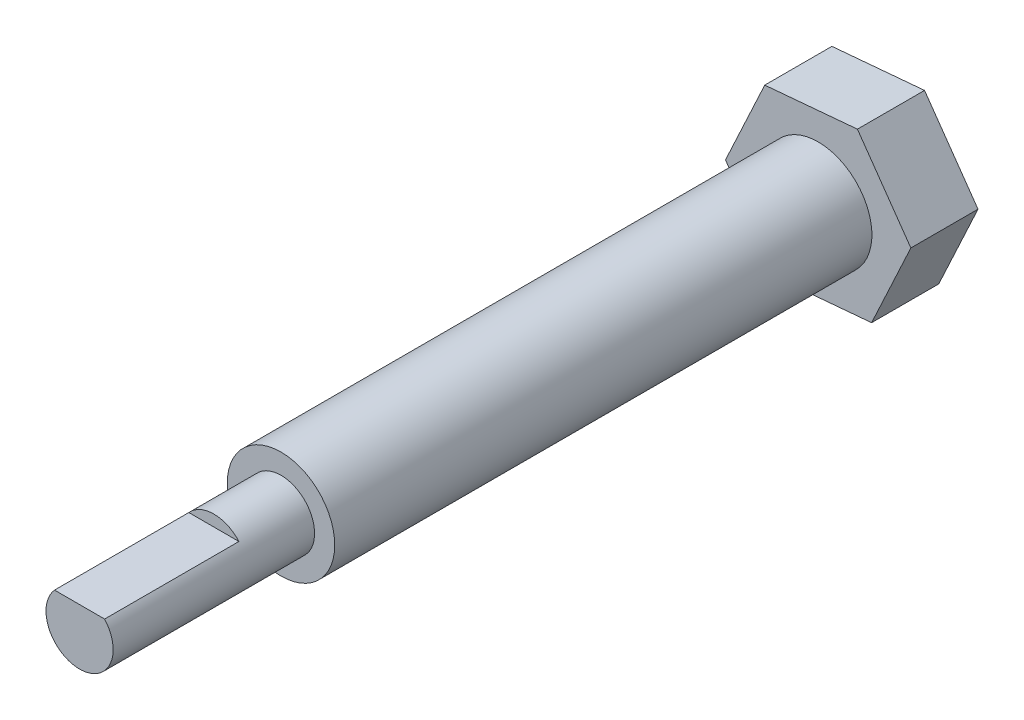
from build123d import *

# Parameters (mm, degrees)
SKETCH1_R           = 19.05
BOSS_EXTRUDE1_DEPTH = 50.8
SKETCH2_R           = 3.175
BOSS_EXTRUDE2_DEPTH = 19.05
SKETCH3_W           = 7.575380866
SKETCH3_H           = 1.446687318
CUT_EXTRUDE1_DEPTH  = 12.7
SKETCH4_R           = 19.824400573
CUT_EXTRUDE2_DEPTH  = 50.8
SKETCH5_R           = 5.08
BOSS_EXTRUDE3_DEPTH = 50.8
BOSS_EXTRUDE4_DEPTH = 6.35


with BuildPart() as part:
    # Sketch1 → Boss-Extrude1 (new body)
    with BuildSketch(Plane.XY):
        Circle(SKETCH1_R)
    extrude(amount=BOSS_EXTRUDE1_DEPTH)

    # Sketch2 → Boss-Extrude2 (add)
    with BuildSketch(Plane.XY.offset(50.8)):
        with Locations(Location((0, 0, 0), (0, 0, 180))):
            Circle(SKETCH2_R)
    extrude(amount=BOSS_EXTRUDE2_DEPTH)

    # Sketch3 → Cut-Extrude1 (cut)
    with BuildSketch(Plane.XY.offset(69.85)):
        with Locations((0.155919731, 2.835726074)):
            Rectangle(SKETCH3_W, SKETCH3_H)
    extrude(amount=-CUT_EXTRUDE1_DEPTH, mode=Mode.SUBTRACT)

    # Sketch4 → Cut-Extrude2 (cut)
    with BuildSketch(Plane(origin=(0, 0, 0), x_dir=(-1, 0, 0), z_dir=(0, 0, -1))):
        Circle(SKETCH4_R)
    extrude(amount=-CUT_EXTRUDE2_DEPTH, mode=Mode.SUBTRACT)

    # Sketch5 → Boss-Extrude3 (add)
    with BuildSketch(Plane.XY):
        Circle(SKETCH5_R)
    extrude(amount=BOSS_EXTRUDE3_DEPTH)

    # Sketch6 → Boss-Extrude4 (add)
    with BuildSketch(Plane(origin=(0, 0, 0), x_dir=(-1, 0, 0), z_dir=(0, 0, -1))):
        Polygon((3.711053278, -7.977924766), (8.764612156, -0.775095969), (5.053558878, 7.202828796), (-3.711053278, 7.977924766), (-8.764612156, 0.775095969), (-5.053558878, -7.202828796), align=None)
    extrude(amount=BOSS_EXTRUDE4_DEPTH)


solid = part.part
